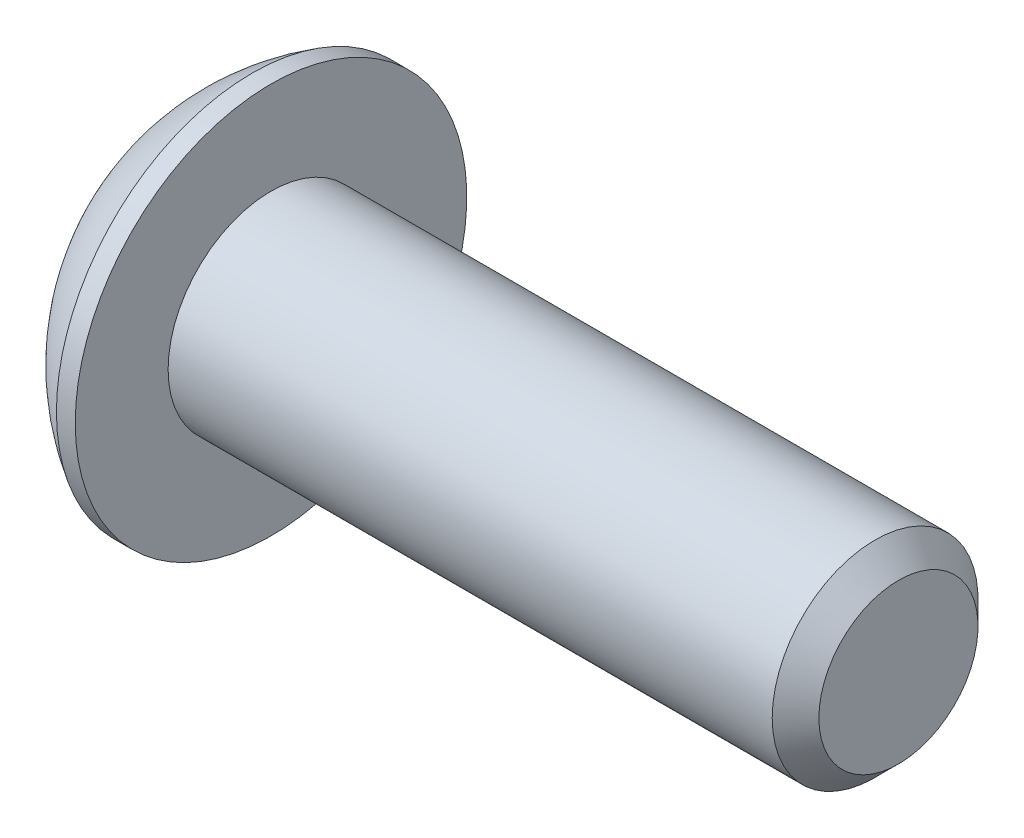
from build123d import *

# Parameters (mm, degrees)
HEX_2_DEPTH = 1.3208


with BuildPart() as part:
    # BodySke → BaseBody (revolve)
    with BuildSketch(Plane.XY, mode=Mode.PRIVATE) as basebody_sk:
        with BuildLine():
            Line((14.9098, 0), (14.9098, 1.61036))
            Line((14.9098, 1.61036), (14.43736, 2.0828))
            Line((14.43736, 2.0828), (2.2098, 2.0828))
            Line((2.2098, 2.0828), (2.2098, 3.9624))
            Line((2.2098, 3.9624), (1.8288, 3.9624))
            ThreePointArc((1.8288, 3.9624), (0.765445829, 3.109296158), (0, 1.9812))
            Line((0, 1.9812), (0, 0))
            Line((0, 0), (14.9098, 0))
        make_face()
    revolve(basebody_sk.sketch.rotate(Axis((0, 0, 0), (1, 0, 0)), 90), axis=Axis((0, 0, 0), (1, 0, 0)))

    # Sketch2 → PreBroach (revolve, cut)
    with BuildSketch(Plane.XY, mode=Mode.PRIVATE) as prebroach_sk:
        Polygon((0, 1.1938), (1.3208, 1.1938), (2.010040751, 0), (0, 0), align=None)
    revolve(prebroach_sk.sketch.rotate(Axis((0, 0, 0), (1, 0, 0)), 90), axis=Axis((0, 0, 0), (1, 0, 0)), mode=Mode.SUBTRACT)

    # Sketch3 → Hex 2 (cut)
    with BuildSketch(Plane(origin=(0, 0, 0), x_dir=(0, 0, -1), z_dir=(1, 0, 0))):
        Polygon((-1.1938, -0.689240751), (-1.1938, 0.689240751), (0, 1.378481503), (1.1938, 0.689240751), (1.1938, -0.689240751), (0, -1.378481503), align=None)
    extrude(amount=HEX_2_DEPTH, mode=Mode.SUBTRACT)


solid = part.part
